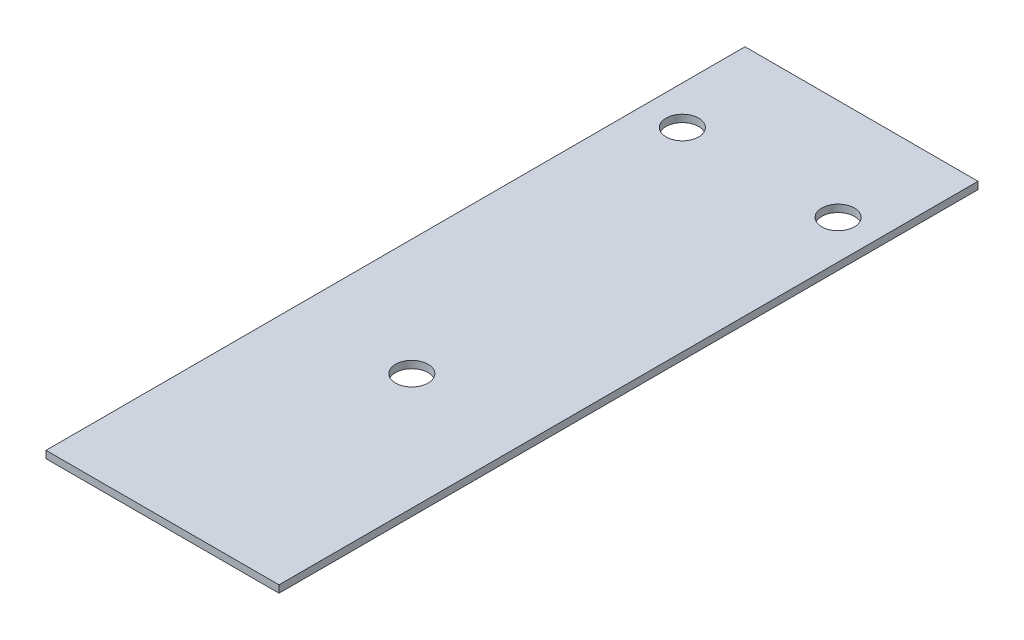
from build123d import *

# Parameters (mm, degrees)
SKETCH1_W           = 152.4
SKETCH1_H           = 457.2
BOSS_EXTRUDE1_DEPTH = 4.7625
SKETCH3_R           = 10.668
CUT_EXTRUDE1_DEPTH  = 242.012616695


with BuildPart() as part:
    # Sketch1 → Boss-Extrude1 (new body)
    with BuildSketch(Plane(origin=(0, 0, 0), x_dir=(1, 0, 0), z_dir=(0, 1, 0))):
        Rectangle(SKETCH1_W, SKETCH1_H)
    extrude(amount=BOSS_EXTRUDE1_DEPTH)

    # Sketch3 → Cut-Extrude1 (cut, through all)
    with BuildSketch(Plane(origin=(0, 4.7625, 0), x_dir=(1, 0, 0), z_dir=(0, 1, 0))):
        with Locations(Location((-50.927, 162.3695, 0), (0, 0, 270))):
            Circle(SKETCH3_R)
        with Locations(Location((50.927, 162.3695, 0), (0, 0, 270))):
            Circle(SKETCH3_R)
        with Locations(Location((0, -65.532, 0), (0, 0, 270))):
            Circle(SKETCH3_R)
    extrude(amount=-CUT_EXTRUDE1_DEPTH, mode=Mode.SUBTRACT)


solid = part.part
